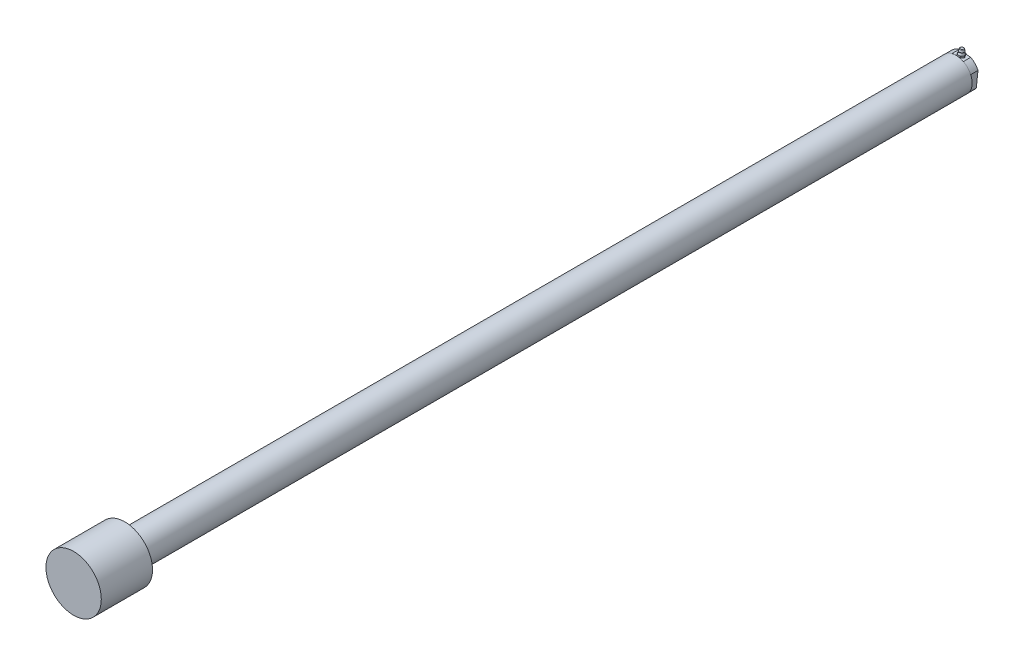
ISO-10303-21;
HEADER;
FILE_DESCRIPTION(('STEP AP214'),'2;1');
FILE_NAME('part.step','',(''),(''),'','','');
FILE_SCHEMA(('AUTOMOTIVE_DESIGN { 1 0 10303 214 1 1 1 1 }'));
ENDSEC;
DATA;
#1=APPLICATION_CONTEXT('core data for automotive mechanical design processes');
#2=APPLICATION_PROTOCOL_DEFINITION('international standard','automotive_design',2000,#1);
#3=PRODUCT_CONTEXT('',#1,'mechanical');
#4=PRODUCT('Part','Part','',(#3));
#5=PRODUCT_RELATED_PRODUCT_CATEGORY('part','',(#4));
#6=PRODUCT_DEFINITION_FORMATION('','',#4);
#7=PRODUCT_DEFINITION_CONTEXT('part definition',#1,'design');
#8=PRODUCT_DEFINITION('design','',#6,#7);
#9=PRODUCT_DEFINITION_SHAPE('','',#8);
#10=(LENGTH_UNIT() NAMED_UNIT(*) SI_UNIT(.MILLI.,.METRE.));
#11=(NAMED_UNIT(*) PLANE_ANGLE_UNIT() SI_UNIT($,.RADIAN.));
#12=(NAMED_UNIT(*) SI_UNIT($,.STERADIAN.) SOLID_ANGLE_UNIT());
#13=UNCERTAINTY_MEASURE_WITH_UNIT(LENGTH_MEASURE(1.E-05),#10,'distance_accuracy_value','');
#14=(GEOMETRIC_REPRESENTATION_CONTEXT(3) GLOBAL_UNCERTAINTY_ASSIGNED_CONTEXT((#13)) GLOBAL_UNIT_ASSIGNED_CONTEXT((#10,
#11,#12)) REPRESENTATION_CONTEXT('',''));
#15=CARTESIAN_POINT('',(0.,0.,0.));
#16=DIRECTION('',(0.,0.,1.));
#17=DIRECTION('',(1.,0.,0.));
#18=AXIS2_PLACEMENT_3D('',#15,#16,#17);
#19=CARTESIAN_POINT('',(0.127238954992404,23.1315063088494,-1188.19295));
#20=DIRECTION('',(0.104528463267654,0.994521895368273,0.));
#21=DIRECTION('',(0.994521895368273,-0.104528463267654,0.));
#22=AXIS2_PLACEMENT_3D('',#19,#20,#21);
#23=PLANE('',#22);
#24=CARTESIAN_POINT('',(2.40604553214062,22.8919940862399,-1184.2242));
#25=DIRECTION('',(-0.104528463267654,-0.994521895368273,0.));
#26=DIRECTION('',(0.,0.,-1.));
#27=AXIS2_PLACEMENT_3D('',#24,#25,#26);
#28=CIRCLE('',#27,3.96875);
#29=CARTESIAN_POINT('',(2.40604553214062,22.8919940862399,-1180.25545));
#30=VERTEX_POINT('',#29);
#31=CARTESIAN_POINT('',(-1.0121643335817,23.2512624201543,-1182.239825));
#32=VERTEX_POINT('',#31);
#33=EDGE_CURVE('E147',#30,#32,#28,.T.);
#34=ORIENTED_EDGE('',*,*,#33,.T.);
#35=DIRECTION('',(0.497260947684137,-0.0522642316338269,0.866025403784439));
#36=VECTOR('',#35,1.);
#37=CARTESIAN_POINT('',(-2.15156762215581,23.371018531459,-1184.2242));
#38=LINE('',#37,#36);
#39=CARTESIAN_POINT('',(0.127238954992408,23.1315063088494,-1180.25545));
#40=VERTEX_POINT('',#39);
#41=EDGE_CURVE('E161',#32,#40,#38,.T.);
#42=ORIENTED_EDGE('',*,*,#41,.T.);
#43=DIRECTION('',(0.994521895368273,-0.104528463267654,0.));
#44=VECTOR('',#43,1.);
#45=CARTESIAN_POINT('',(0.127238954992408,23.1315063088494,-1180.25545));
#46=LINE('',#45,#44);
#47=EDGE_CURVE('E154',#40,#30,#46,.T.);
#48=ORIENTED_EDGE('',*,*,#47,.T.);
#49=EDGE_LOOP('',(#34,#42,#48));
#50=FACE_BOUND('',#49,.T.);
#51=ADVANCED_FACE('F17',(#50),#23,.T.);
#52=CARTESIAN_POINT('',(5.82425539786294,22.5327257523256,-1182.239825));
#53=VERTEX_POINT('',#52);
#54=EDGE_CURVE('E136',#53,#30,#28,.T.);
#55=ORIENTED_EDGE('',*,*,#54,.T.);
#56=CARTESIAN_POINT('',(4.68485210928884,22.6524818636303,-1180.25545));
#57=VERTEX_POINT('',#56);
#58=EDGE_CURVE('E139',#30,#57,#46,.T.);
#59=ORIENTED_EDGE('',*,*,#58,.T.);
#60=DIRECTION('',(0.497260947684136,-0.0522642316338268,-0.866025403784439));
#61=VECTOR('',#60,1.);
#62=CARTESIAN_POINT('',(4.68485210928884,22.6524818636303,-1180.25545));
#63=LINE('',#62,#61);
#64=EDGE_CURVE('E142',#57,#53,#63,.T.);
#65=ORIENTED_EDGE('',*,*,#64,.T.);
#66=EDGE_LOOP('',(#55,#59,#65));
#67=FACE_BOUND('',#66,.T.);
#68=ADVANCED_FACE('F138',(#67),#23,.T.);
#69=CARTESIAN_POINT('',(5.82425539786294,22.5327257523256,-1186.208575));
#70=VERTEX_POINT('',#69);
#71=EDGE_CURVE('E146',#70,#53,#28,.T.);
#72=ORIENTED_EDGE('',*,*,#71,.T.);
#73=CARTESIAN_POINT('',(6.96365868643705,22.4129696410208,-1184.2242));
#74=VERTEX_POINT('',#73);
#75=EDGE_CURVE('E163',#53,#74,#63,.T.);
#76=ORIENTED_EDGE('',*,*,#75,.T.);
#77=DIRECTION('',(-0.497260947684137,0.0522642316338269,-0.866025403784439));
#78=VECTOR('',#77,1.);
#79=CARTESIAN_POINT('',(6.96365868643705,22.4129696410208,-1184.2242));
#80=LINE('',#79,#78);
#81=EDGE_CURVE('E182',#74,#70,#80,.T.);
#82=ORIENTED_EDGE('',*,*,#81,.T.);
#83=EDGE_LOOP('',(#72,#76,#82));
#84=FACE_BOUND('',#83,.T.);
#85=ADVANCED_FACE('F304',(#84),#23,.T.);
#86=CARTESIAN_POINT('',(2.40604553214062,22.8919940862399,-1188.19295));
#87=VERTEX_POINT('',#86);
#88=EDGE_CURVE('E37',#87,#70,#28,.T.);
#89=ORIENTED_EDGE('',*,*,#88,.T.);
#90=CARTESIAN_POINT('',(4.68485210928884,22.6524818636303,-1188.19295));
#91=VERTEX_POINT('',#90);
#92=EDGE_CURVE('E181',#70,#91,#80,.T.);
#93=ORIENTED_EDGE('',*,*,#92,.T.);
#94=DIRECTION('',(-0.994521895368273,0.104528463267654,0.));
#95=VECTOR('',#94,1.);
#96=CARTESIAN_POINT('',(4.68485210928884,22.6524818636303,-1188.19295));
#97=LINE('',#96,#95);
#98=EDGE_CURVE('E172',#91,#87,#97,.T.);
#99=ORIENTED_EDGE('',*,*,#98,.T.);
#100=EDGE_LOOP('',(#89,#93,#99));
#101=FACE_BOUND('',#100,.T.);
#102=ADVANCED_FACE('F322',(#101),#23,.T.);
#103=CARTESIAN_POINT('',(-1.0121643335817,23.2512624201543,-1186.208575));
#104=VERTEX_POINT('',#103);
#105=EDGE_CURVE('E167',#104,#87,#28,.T.);
#106=ORIENTED_EDGE('',*,*,#105,.T.);
#107=CARTESIAN_POINT('',(0.127238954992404,23.1315063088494,-1188.19295));
#108=VERTEX_POINT('',#107);
#109=EDGE_CURVE('E175',#87,#108,#97,.T.);
#110=ORIENTED_EDGE('',*,*,#109,.T.);
#111=DIRECTION('',(-0.497260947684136,0.0522642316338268,0.866025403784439));
#112=VECTOR('',#111,1.);
#113=CARTESIAN_POINT('',(0.127238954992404,23.1315063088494,-1188.19295));
#114=LINE('',#113,#112);
#115=EDGE_CURVE('E176',#108,#104,#114,.T.);
#116=ORIENTED_EDGE('',*,*,#115,.T.);
#117=EDGE_LOOP('',(#106,#110,#116));
#118=FACE_BOUND('',#117,.T.);
#119=ADVANCED_FACE('F310',(#118),#23,.T.);
#120=CARTESIAN_POINT('',(4.68485210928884,22.6524818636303,-1188.19295));
#121=DIRECTION('',(0.,0.,1.));
#122=DIRECTION('',(-0.104528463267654,-0.994521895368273,0.));
#123=AXIS2_PLACEMENT_3D('',#120,#121,#122);
#124=PLANE('',#123);
#125=DIRECTION('',(-0.994521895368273,0.104528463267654,0.));
#126=VECTOR('',#125,1.);
#127=CARTESIAN_POINT('',(4.43594370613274,20.2842766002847,-1188.19295));
#128=LINE('',#127,#126);
#129=CARTESIAN_POINT('',(4.43594370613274,20.2842766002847,-1188.19295));
#130=VERTEX_POINT('',#129);
#131=CARTESIAN_POINT('',(-0.121669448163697,20.7633010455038,-1188.19295));
#132=VERTEX_POINT('',#131);
#133=EDGE_CURVE('E170',#130,#132,#128,.T.);
#134=ORIENTED_EDGE('',*,*,#133,.T.);
#135=DIRECTION('',(-0.104528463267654,-0.994521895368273,0.));
#136=VECTOR('',#135,1.);
#137=CARTESIAN_POINT('',(0.127238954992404,23.1315063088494,-1188.19295));
#138=LINE('',#137,#136);
#139=EDGE_CURVE('E209',#108,#132,#138,.T.);
#140=ORIENTED_EDGE('',*,*,#139,.F.);
#141=ORIENTED_EDGE('',*,*,#109,.F.);
#142=ORIENTED_EDGE('',*,*,#98,.F.);
#143=DIRECTION('',(-0.104528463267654,-0.994521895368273,0.));
#144=VECTOR('',#143,1.);
#145=CARTESIAN_POINT('',(4.68485210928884,22.6524818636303,-1188.19295));
#146=LINE('',#145,#144);
#147=EDGE_CURVE('E185',#91,#130,#146,.T.);
#148=ORIENTED_EDGE('',*,*,#147,.T.);
#149=EDGE_LOOP('',(#134,#140,#141,#142,#148));
#150=FACE_BOUND('',#149,.T.);
#151=ADVANCED_FACE('F321',(#150),#124,.F.);
#152=CARTESIAN_POINT('',(0.127238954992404,23.1315063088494,-1188.19295));
#153=DIRECTION('',(0.861281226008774,-0.0905243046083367,0.5));
#154=DIRECTION('',(0.497260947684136,-0.0522642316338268,-0.866025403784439));
#155=AXIS2_PLACEMENT_3D('',#152,#153,#154);
#156=PLANE('',#155);
#157=DIRECTION('',(-0.497260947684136,0.0522642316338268,0.866025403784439));
#158=VECTOR('',#157,1.);
#159=CARTESIAN_POINT('',(-0.121669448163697,20.7633010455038,-1188.19295));
#160=LINE('',#159,#158);
#161=CARTESIAN_POINT('',(-2.40047602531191,21.0028132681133,-1184.2242));
#162=VERTEX_POINT('',#161);
#163=EDGE_CURVE('E188',#132,#162,#160,.T.);
#164=ORIENTED_EDGE('',*,*,#163,.T.);
#165=DIRECTION('',(-0.104528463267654,-0.994521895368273,0.));
#166=VECTOR('',#165,1.);
#167=CARTESIAN_POINT('',(-2.15156762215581,23.371018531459,-1184.2242));
#168=LINE('',#167,#166);
#169=CARTESIAN_POINT('',(-2.15156762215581,23.371018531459,-1184.2242));
#170=VERTEX_POINT('',#169);
#171=EDGE_CURVE('E206',#170,#162,#168,.T.);
#172=ORIENTED_EDGE('',*,*,#171,.F.);
#173=EDGE_CURVE('E174',#104,#170,#114,.T.);
#174=ORIENTED_EDGE('',*,*,#173,.F.);
#175=ORIENTED_EDGE('',*,*,#115,.F.);
#176=ORIENTED_EDGE('',*,*,#139,.T.);
#177=EDGE_LOOP('',(#164,#172,#174,#175,#176));
#178=FACE_BOUND('',#177,.T.);
#179=ADVANCED_FACE('F329',(#178),#156,.F.);
#180=CARTESIAN_POINT('',(-2.15156762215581,23.371018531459,-1184.2242));
#181=DIRECTION('',(0.861281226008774,-0.0905243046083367,-0.5));
#182=DIRECTION('',(-0.497260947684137,0.0522642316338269,-0.866025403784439));
#183=AXIS2_PLACEMENT_3D('',#180,#181,#182);
#184=PLANE('',#183);
#185=DIRECTION('',(0.497260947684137,-0.0522642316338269,0.866025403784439));
#186=VECTOR('',#185,1.);
#187=CARTESIAN_POINT('',(-2.40047602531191,21.0028132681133,-1184.2242));
#188=LINE('',#187,#186);
#189=CARTESIAN_POINT('',(-0.121669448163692,20.7633010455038,-1180.25545));
#190=VERTEX_POINT('',#189);
#191=EDGE_CURVE('E190',#162,#190,#188,.T.);
#192=ORIENTED_EDGE('',*,*,#191,.T.);
#193=DIRECTION('',(-0.104528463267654,-0.994521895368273,0.));
#194=VECTOR('',#193,1.);
#195=CARTESIAN_POINT('',(0.127238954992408,23.1315063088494,-1180.25545));
#196=LINE('',#195,#194);
#197=EDGE_CURVE('E204',#40,#190,#196,.T.);
#198=ORIENTED_EDGE('',*,*,#197,.F.);
#199=ORIENTED_EDGE('',*,*,#41,.F.);
#200=EDGE_CURVE('E92',#170,#32,#38,.T.);
#201=ORIENTED_EDGE('',*,*,#200,.F.);
#202=ORIENTED_EDGE('',*,*,#171,.T.);
#203=EDGE_LOOP('',(#192,#198,#199,#201,#202));
#204=FACE_BOUND('',#203,.T.);
#205=ADVANCED_FACE('F351',(#204),#184,.F.);
#206=CARTESIAN_POINT('',(0.127238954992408,23.1315063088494,-1180.25545));
#207=DIRECTION('',(0.,0.,-1.));
#208=DIRECTION('',(-0.994521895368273,0.104528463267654,0.));
#209=AXIS2_PLACEMENT_3D('',#206,#207,#208);
#210=PLANE('',#209);
#211=DIRECTION('',(0.994521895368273,-0.104528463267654,0.));
#212=VECTOR('',#211,1.);
#213=CARTESIAN_POINT('',(-0.121669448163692,20.7633010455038,-1180.25545));
#214=LINE('',#213,#212);
#215=CARTESIAN_POINT('',(4.43594370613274,20.2842766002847,-1180.25545));
#216=VERTEX_POINT('',#215);
#217=EDGE_CURVE('E192',#190,#216,#214,.T.);
#218=ORIENTED_EDGE('',*,*,#217,.T.);
#219=DIRECTION('',(-0.104528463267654,-0.994521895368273,0.));
#220=VECTOR('',#219,1.);
#221=CARTESIAN_POINT('',(4.68485210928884,22.6524818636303,-1180.25545));
#222=LINE('',#221,#220);
#223=EDGE_CURVE('E156',#57,#216,#222,.T.);
#224=ORIENTED_EDGE('',*,*,#223,.F.);
#225=ORIENTED_EDGE('',*,*,#58,.F.);
#226=ORIENTED_EDGE('',*,*,#47,.F.);
#227=ORIENTED_EDGE('',*,*,#197,.T.);
#228=EDGE_LOOP('',(#218,#224,#225,#226,#227));
#229=FACE_BOUND('',#228,.T.);
#230=ADVANCED_FACE('F152',(#229),#210,.F.);
#231=CARTESIAN_POINT('',(4.68485210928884,22.6524818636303,-1180.25545));
#232=DIRECTION('',(-0.861281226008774,0.0905243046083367,-0.5));
#233=DIRECTION('',(-0.497260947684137,0.0522642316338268,0.866025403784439));
#234=AXIS2_PLACEMENT_3D('',#231,#232,#233);
#235=PLANE('',#234);
#236=DIRECTION('',(0.497260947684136,-0.0522642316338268,-0.866025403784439));
#237=VECTOR('',#236,1.);
#238=CARTESIAN_POINT('',(4.43594370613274,20.2842766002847,-1180.25545));
#239=LINE('',#238,#237);
#240=CARTESIAN_POINT('',(6.71475028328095,20.0447643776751,-1184.2242));
#241=VERTEX_POINT('',#240);
#242=EDGE_CURVE('E194',#216,#241,#239,.T.);
#243=ORIENTED_EDGE('',*,*,#242,.T.);
#244=DIRECTION('',(-0.104528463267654,-0.994521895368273,0.));
#245=VECTOR('',#244,1.);
#246=CARTESIAN_POINT('',(6.96365868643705,22.4129696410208,-1184.2242));
#247=LINE('',#246,#245);
#248=EDGE_CURVE('E200',#74,#241,#247,.T.);
#249=ORIENTED_EDGE('',*,*,#248,.F.);
#250=ORIENTED_EDGE('',*,*,#75,.F.);
#251=ORIENTED_EDGE('',*,*,#64,.F.);
#252=ORIENTED_EDGE('',*,*,#223,.T.);
#253=EDGE_LOOP('',(#243,#249,#250,#251,#252));
#254=FACE_BOUND('',#253,.T.);
#255=ADVANCED_FACE('F318',(#254),#235,.F.);
#256=CARTESIAN_POINT('',(6.96365868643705,22.4129696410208,-1184.2242));
#257=DIRECTION('',(-0.861281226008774,0.0905243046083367,0.5));
#258=DIRECTION('',(0.497260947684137,-0.0522642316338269,0.866025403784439));
#259=AXIS2_PLACEMENT_3D('',#256,#257,#258);
#260=PLANE('',#259);
#261=DIRECTION('',(-0.497260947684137,0.0522642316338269,-0.866025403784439));
#262=VECTOR('',#261,1.);
#263=CARTESIAN_POINT('',(6.71475028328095,20.0447643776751,-1184.2242));
#264=LINE('',#263,#262);
#265=EDGE_CURVE('E196',#241,#130,#264,.T.);
#266=ORIENTED_EDGE('',*,*,#265,.T.);
#267=ORIENTED_EDGE('',*,*,#147,.F.);
#268=ORIENTED_EDGE('',*,*,#92,.F.);
#269=ORIENTED_EDGE('',*,*,#81,.F.);
#270=ORIENTED_EDGE('',*,*,#248,.T.);
#271=EDGE_LOOP('',(#266,#267,#268,#269,#270));
#272=FACE_BOUND('',#271,.T.);
#273=ADVANCED_FACE('F309',(#272),#260,.F.);
#274=EDGE_CURVE('E166',#32,#104,#28,.T.);
#275=ORIENTED_EDGE('',*,*,#274,.T.);
#276=ORIENTED_EDGE('',*,*,#173,.T.);
#277=ORIENTED_EDGE('',*,*,#200,.T.);
#278=EDGE_LOOP('',(#275,#276,#277));
#279=FACE_BOUND('',#278,.T.);
#280=ADVANCED_FACE('F299',(#279),#23,.T.);
#281=CARTESIAN_POINT('',(2.79268325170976,26.5706062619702,-1184.2242));
#282=DIRECTION('',(-0.104528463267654,-0.994521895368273,0.));
#283=DIRECTION('',(0.,0.,-1.));
#284=AXIS2_PLACEMENT_3D('',#281,#282,#283);
#285=CONICAL_SURFACE('',#284,3.3655,0.340381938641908);
#286=CARTESIAN_POINT('',(3.05822647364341,29.0970812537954,-1184.2242));
#287=DIRECTION('',(0.104528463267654,0.994521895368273,0.));
#288=DIRECTION('',(0.,0.,1.));
#289=AXIS2_PLACEMENT_3D('',#286,#287,#288);
#290=CIRCLE('',#289,2.46577800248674);
#291=CARTESIAN_POINT('',(3.0582264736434,29.0970812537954,-1186.68997800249));
#292=VERTEX_POINT('',#291);
#293=EDGE_CURVE('E212',#292,#292,#290,.F.);
#294=CARTESIAN_POINT('',(2.79268325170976,26.5706062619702,-1184.2242));
#295=DIRECTION('',(-0.104528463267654,-0.994521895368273,0.));
#296=DIRECTION('',(0.,0.,-1.));
#297=AXIS2_PLACEMENT_3D('',#294,#295,#296);
#298=CIRCLE('',#297,3.3655);
#299=CARTESIAN_POINT('',(2.79268325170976,26.5706062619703,-1187.5897));
#300=VERTEX_POINT('',#299);
#301=EDGE_CURVE('E171',#300,#300,#298,.T.);
#302=CARTESIAN_POINT('',(3.0582264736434,29.0970812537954,-1186.68997800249));
#303=CARTESIAN_POINT('',(3.05546039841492,29.0707638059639,-1186.69935010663));
#304=CARTESIAN_POINT('',(3.05269432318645,29.0444463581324,-1186.70872221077));
#305=CARTESIAN_POINT('',(3.0471621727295,28.9918114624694,-1186.72746641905));
#306=CARTESIAN_POINT('',(3.04439609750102,28.9654940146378,-1186.73683852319));
#307=CARTESIAN_POINT('',(3.03886394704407,28.9128591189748,-1186.75558273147));
#308=CARTESIAN_POINT('',(3.0360978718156,28.8865416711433,-1186.76495483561));
#309=CARTESIAN_POINT('',(3.03056572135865,28.8339067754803,-1186.78369904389));
#310=CARTESIAN_POINT('',(3.02779964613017,28.8075893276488,-1186.79307114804));
#311=CARTESIAN_POINT('',(3.02226749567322,28.7549544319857,-1186.81181535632));
#312=CARTESIAN_POINT('',(3.01950142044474,28.7286369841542,-1186.82118746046));
#313=CARTESIAN_POINT('',(3.01396926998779,28.6760020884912,-1186.83993166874));
#314=CARTESIAN_POINT('',(3.01120319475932,28.6496846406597,-1186.84930377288));
#315=CARTESIAN_POINT('',(3.00567104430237,28.5970497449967,-1186.86804798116));
#316=CARTESIAN_POINT('',(3.00290496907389,28.5707322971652,-1186.8774200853));
#317=CARTESIAN_POINT('',(2.99737281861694,28.5180974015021,-1186.89616429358));
#318=CARTESIAN_POINT('',(2.99460674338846,28.4917799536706,-1186.90553639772));
#319=CARTESIAN_POINT('',(2.98907459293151,28.4391450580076,-1186.92428060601));
#320=CARTESIAN_POINT('',(2.98630851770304,28.4128276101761,-1186.93365271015));
#321=CARTESIAN_POINT('',(2.98077636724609,28.3601927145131,-1186.95239691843));
#322=CARTESIAN_POINT('',(2.97801029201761,28.3338752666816,-1186.96176902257));
#323=CARTESIAN_POINT('',(2.97247814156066,28.2812403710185,-1186.98051323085));
#324=CARTESIAN_POINT('',(2.96971206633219,28.254922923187,-1186.98988533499));
#325=CARTESIAN_POINT('',(2.96417991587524,28.202288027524,-1187.00862954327));
#326=CARTESIAN_POINT('',(2.96141384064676,28.1759705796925,-1187.01800164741));
#327=CARTESIAN_POINT('',(2.95588169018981,28.1233356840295,-1187.0367458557));
#328=CARTESIAN_POINT('',(2.95311561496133,28.0970182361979,-1187.04611795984));
#329=CARTESIAN_POINT('',(2.94758346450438,28.0443833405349,-1187.06486216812));
#330=CARTESIAN_POINT('',(2.94481738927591,28.0180658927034,-1187.07423427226));
#331=CARTESIAN_POINT('',(2.93928523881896,27.9654309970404,-1187.09297848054));
#332=CARTESIAN_POINT('',(2.93651916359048,27.9391135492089,-1187.10235058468));
#333=CARTESIAN_POINT('',(2.93098701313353,27.8864786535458,-1187.12109479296));
#334=CARTESIAN_POINT('',(2.92822093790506,27.8601612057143,-1187.1304668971));
#335=CARTESIAN_POINT('',(2.92268878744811,27.8075263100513,-1187.14921110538));
#336=CARTESIAN_POINT('',(2.91992271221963,27.7812088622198,-1187.15858320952));
#337=CARTESIAN_POINT('',(2.91439056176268,27.7285739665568,-1187.17732741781));
#338=CARTESIAN_POINT('',(2.9116244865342,27.7022565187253,-1187.18669952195));
#339=CARTESIAN_POINT('',(2.90609233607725,27.6496216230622,-1187.20544373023));
#340=CARTESIAN_POINT('',(2.90332626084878,27.6233041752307,-1187.21481583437));
#341=CARTESIAN_POINT('',(2.89779411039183,27.5706692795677,-1187.23356004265));
#342=CARTESIAN_POINT('',(2.89502803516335,27.5443518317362,-1187.24293214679));
#343=CARTESIAN_POINT('',(2.8894958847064,27.4917169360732,-1187.26167635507));
#344=CARTESIAN_POINT('',(2.88672980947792,27.4653994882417,-1187.27104845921));
#345=CARTESIAN_POINT('',(2.88119765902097,27.4127645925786,-1187.2897926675));
#346=CARTESIAN_POINT('',(2.8784315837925,27.3864471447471,-1187.29916477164));
#347=CARTESIAN_POINT('',(2.87289943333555,27.3338122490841,-1187.31790897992));
#348=CARTESIAN_POINT('',(2.87013335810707,27.3074948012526,-1187.32728108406));
#349=CARTESIAN_POINT('',(2.86460120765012,27.2548599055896,-1187.34602529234));
#350=CARTESIAN_POINT('',(2.86183513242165,27.2285424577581,-1187.35539739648));
#351=CARTESIAN_POINT('',(2.85630298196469,27.175907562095,-1187.37414160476));
#352=CARTESIAN_POINT('',(2.85353690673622,27.1495901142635,-1187.3835137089));
#353=CARTESIAN_POINT('',(2.84800475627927,27.0969552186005,-1187.40225791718));
#354=CARTESIAN_POINT('',(2.84523868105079,27.070637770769,-1187.41163002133));
#355=CARTESIAN_POINT('',(2.83970653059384,27.018002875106,-1187.43037422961));
#356=CARTESIAN_POINT('',(2.83694045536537,26.9916854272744,-1187.43974633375));
#357=CARTESIAN_POINT('',(2.83140830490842,26.9390505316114,-1187.45849054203));
#358=CARTESIAN_POINT('',(2.82864222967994,26.9127330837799,-1187.46786264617));
#359=CARTESIAN_POINT('',(2.82311007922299,26.8600981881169,-1187.48660685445));
#360=CARTESIAN_POINT('',(2.82034400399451,26.8337807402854,-1187.49597895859));
#361=CARTESIAN_POINT('',(2.81481185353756,26.7811458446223,-1187.51472316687));
#362=CARTESIAN_POINT('',(2.81204577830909,26.7548283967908,-1187.52409527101));
#363=CARTESIAN_POINT('',(2.80651362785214,26.7021935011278,-1187.5428394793));
#364=CARTESIAN_POINT('',(2.80374755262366,26.6758760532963,-1187.55221158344));
#365=CARTESIAN_POINT('',(2.79821540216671,26.6232411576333,-1187.57095579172));
#366=CARTESIAN_POINT('',(2.79544932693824,26.5969237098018,-1187.58032789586));
#367=CARTESIAN_POINT('',(2.79268325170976,26.5706062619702,-1187.5897));
#368=B_SPLINE_CURVE_WITH_KNOTS('',3,(#302,#303,#304,#305,#306,#307,#308,#309,#310,#311,#312,
#313,#314,#315,#316,#317,#318,#319,#320,#321,#322,#323,#324,#325,#326,#327,#328,#329,#330,#331,
#332,#333,#334,#335,#336,#337,#338,#339,#340,#341,#342,#343,#344,#345,#346,#347,#348,#349,#350,
#351,#352,#353,#354,#355,#356,#357,#358,#359,#360,#361,#362,#363,#364,#365,#366,#367),
.UNSPECIFIED.,.F.,.F.,(4,2,2,2,2,2,2,2,2,2,2,2,2,2,2,2,2,2,2,2,2,2,2,2,2,2,2,2,2,2,2,2,4),(0.,
0.0842191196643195,0.168438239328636,0.252657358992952,0.336876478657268,0.421095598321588,
0.505314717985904,0.58953383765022,0.673752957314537,0.757972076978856,0.842191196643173,
0.926410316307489,1.0106294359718,1.09484855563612,1.17906767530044,1.26328679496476,
1.34750591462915,1.43172503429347,1.51594415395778,1.6001632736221,1.68438239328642,
1.76860151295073,1.85282063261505,1.93703975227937,2.02125887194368,2.105477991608,
2.18969711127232,2.27391623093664,2.35813535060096,2.44235447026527,2.52657358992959,
2.6107927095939,2.69501182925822),.UNSPECIFIED.);
#369=EDGE_CURVE('BSEAM308',#292,#300,#368,.T.);
#370=ORIENTED_EDGE('',*,*,#293,.T.);
#371=ORIENTED_EDGE('',*,*,#301,.F.);
#372=ORIENTED_EDGE('',*,*,#369,.T.);
#373=ORIENTED_EDGE('',*,*,#369,.F.);
#374=EDGE_LOOP('',(#370,#372,#371,#373));
#375=FACE_BOUND('',#374,.T.);
#376=ADVANCED_FACE('F308',(#375),#285,.T.);
#377=CARTESIAN_POINT('',(3.11128600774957,29.6019089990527,-1184.2242));
#378=DIRECTION('',(0.104528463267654,0.994521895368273,0.));
#379=DIRECTION('',(0.,0.,1.));
#380=AXIS2_PLACEMENT_3D('',#377,#378,#379);
#381=PLANE('',#380);
#382=CARTESIAN_POINT('',(3.11128600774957,29.6019089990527,-1184.2242));
#383=DIRECTION('',(0.104528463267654,0.994521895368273,0.));
#384=DIRECTION('',(0.,0.,1.));
#385=AXIS2_PLACEMENT_3D('',#382,#383,#384);
#386=CIRCLE('',#385,1.7474960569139);
#387=CARTESIAN_POINT('',(3.11128600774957,29.6019089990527,-1182.47670394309));
#388=VERTEX_POINT('',#387);
#389=EDGE_CURVE('E28',#388,#388,#386,.T.);
#390=ORIENTED_EDGE('',*,*,#389,.T.);
#391=EDGE_LOOP('',(#390));
#392=FACE_BOUND('',#391,.T.);
#393=ADVANCED_FACE('F316',(#392),#381,.T.);
#394=CARTESIAN_POINT('',(2.62561438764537,24.9810522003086,-1184.2242));
#395=DIRECTION('',(-0.104528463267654,-0.994521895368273,0.));
#396=DIRECTION('',(0.,0.,-1.));
#397=AXIS2_PLACEMENT_3D('',#394,#395,#396);
#398=TOROIDAL_SURFACE('',#397,5.20693450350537,2.43833450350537);
#399=ORIENTED_EDGE('',*,*,#301,.T.);
#400=EDGE_LOOP('',(#399));
#401=FACE_BOUND('',#400,.T.);
#402=ORIENTED_EDGE('',*,*,#88,.F.);
#403=ORIENTED_EDGE('',*,*,#105,.F.);
#404=ORIENTED_EDGE('',*,*,#274,.F.);
#405=ORIENTED_EDGE('',*,*,#33,.F.);
#406=ORIENTED_EDGE('',*,*,#54,.F.);
#407=ORIENTED_EDGE('',*,*,#71,.F.);
#408=EDGE_LOOP('',(#402,#403,#404,#405,#406,#407));
#409=FACE_BOUND('',#408,.T.);
#410=ADVANCED_FACE('F164',(#401,#409),#398,.F.);
#411=CARTESIAN_POINT('',(3.03163531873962,28.8440833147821,-1184.2242));
#412=DIRECTION('',(0.104528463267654,0.994521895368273,0.));
#413=DIRECTION('',(0.,0.,1.));
#414=AXIS2_PLACEMENT_3D('',#411,#412,#413);
#415=TOROIDAL_SURFACE('',#414,1.7474960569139,0.762);
#416=ORIENTED_EDGE('',*,*,#389,.F.);
#417=EDGE_LOOP('',(#416));
#418=FACE_BOUND('',#417,.T.);
#419=ORIENTED_EDGE('',*,*,#293,.F.);
#420=EDGE_LOOP('',(#419));
#421=FACE_BOUND('',#420,.T.);
#422=ADVANCED_FACE('F410',(#418,#421),#415,.T.);
#423=CARTESIAN_POINT('',(0.,0.,35.56));
#424=DIRECTION('',(0.,0.,1.));
#425=DIRECTION('',(1.,0.,0.));
#426=AXIS2_PLACEMENT_3D('',#423,#424,#425);
#427=PLANE('',#426);
#428=CARTESIAN_POINT('',(0.,0.,35.56));
#429=DIRECTION('',(0.,0.,1.));
#430=DIRECTION('',(1.,0.,0.));
#431=AXIS2_PLACEMENT_3D('',#428,#429,#430);
#432=CIRCLE('',#431,38.1);
#433=CARTESIAN_POINT('',(38.1,0.,35.56));
#434=VERTEX_POINT('',#433);
#435=EDGE_CURVE('E261',#434,#434,#432,.T.);
#436=ORIENTED_EDGE('',*,*,#435,.T.);
#437=EDGE_LOOP('',(#436));
#438=FACE_BOUND('',#437,.T.);
#439=ADVANCED_FACE('F412',(#438),#427,.T.);
#440=CARTESIAN_POINT('',(0.,0.,-34.925));
#441=DIRECTION('',(0.,0.,1.));
#442=DIRECTION('',(1.,0.,0.));
#443=AXIS2_PLACEMENT_3D('',#440,#441,#442);
#444=CYLINDRICAL_SURFACE('',#443,38.1);
#445=CARTESIAN_POINT('',(0.,0.,-34.925));
#446=DIRECTION('',(0.,0.,1.));
#447=DIRECTION('',(1.,0.,0.));
#448=AXIS2_PLACEMENT_3D('',#445,#446,#447);
#449=CIRCLE('',#448,38.1);
#450=CARTESIAN_POINT('',(38.1,0.,-34.925));
#451=VERTEX_POINT('',#450);
#452=EDGE_CURVE('E264',#451,#451,#449,.T.);
#453=ORIENTED_EDGE('',*,*,#452,.T.);
#454=EDGE_LOOP('',(#453));
#455=FACE_BOUND('',#454,.T.);
#456=ORIENTED_EDGE('',*,*,#435,.F.);
#457=EDGE_LOOP('',(#456));
#458=FACE_BOUND('',#457,.T.);
#459=ADVANCED_FACE('F408',(#455,#458),#444,.T.);
#460=CARTESIAN_POINT('',(0.,0.,-1151.2042));
#461=DIRECTION('',(0.,0.,-1.));
#462=DIRECTION('',(0.104528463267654,0.994521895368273,0.));
#463=AXIS2_PLACEMENT_3D('',#460,#461,#462);
#464=PLANE('',#463);
#465=CARTESIAN_POINT('',(0.,0.,-1151.2042));
#466=DIRECTION('',(0.,0.,-1.));
#467=DIRECTION('',(0.104528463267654,0.994521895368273,0.));
#468=AXIS2_PLACEMENT_3D('',#465,#466,#467);
#469=CIRCLE('',#468,8.73125);
#470=CARTESIAN_POINT('',(0.912664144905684,8.68341929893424,-1151.2042));
#471=VERTEX_POINT('',#470);
#472=EDGE_CURVE('E217',#471,#471,#469,.T.);
#473=ORIENTED_EDGE('',*,*,#472,.T.);
#474=EDGE_LOOP('',(#473));
#475=FACE_BOUND('',#474,.T.);
#476=ADVANCED_FACE('F292',(#475),#464,.T.);
#477=CARTESIAN_POINT('',(0.,0.,-34.925));
#478=DIRECTION('',(0.,0.,1.));
#479=DIRECTION('',(1.,0.,0.));
#480=AXIS2_PLACEMENT_3D('',#477,#478,#479);
#481=PLANE('',#480);
#482=ORIENTED_EDGE('',*,*,#452,.F.);
#483=EDGE_LOOP('',(#482));
#484=FACE_BOUND('',#483,.T.);
#485=CARTESIAN_POINT('',(0.,0.,-34.925));
#486=DIRECTION('',(0.,0.,1.));
#487=DIRECTION('',(1.,0.,0.));
#488=AXIS2_PLACEMENT_3D('',#485,#486,#487);
#489=CIRCLE('',#488,22.225);
#490=CARTESIAN_POINT('',(22.225,0.,-34.925));
#491=VERTEX_POINT('',#490);
#492=EDGE_CURVE('E21',#491,#491,#489,.T.);
#493=ORIENTED_EDGE('',*,*,#492,.T.);
#494=EDGE_LOOP('',(#493));
#495=FACE_BOUND('',#494,.T.);
#496=ADVANCED_FACE('F273',(#484,#495),#481,.F.);
#497=CARTESIAN_POINT('',(0.,0.,-1189.3042));
#498=DIRECTION('',(0.,0.,-1.));
#499=DIRECTION('',(0.104528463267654,0.994521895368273,0.));
#500=AXIS2_PLACEMENT_3D('',#497,#498,#499);
#501=CYLINDRICAL_SURFACE('',#500,8.73125);
#502=ORIENTED_EDGE('',*,*,#472,.F.);
#503=EDGE_LOOP('',(#502));
#504=FACE_BOUND('',#503,.T.);
#505=CARTESIAN_POINT('',(0.,0.,-1189.3042));
#506=DIRECTION('',(0.,0.,-1.));
#507=DIRECTION('',(0.104528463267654,0.994521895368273,0.));
#508=AXIS2_PLACEMENT_3D('',#505,#506,#507);
#509=CIRCLE('',#508,8.73125);
#510=CARTESIAN_POINT('',(0.912664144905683,8.68341929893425,-1189.3042));
#511=VERTEX_POINT('',#510);
#512=EDGE_CURVE('E249',#511,#511,#509,.T.);
#513=ORIENTED_EDGE('',*,*,#512,.T.);
#514=EDGE_LOOP('',(#513));
#515=FACE_BOUND('',#514,.T.);
#516=ADVANCED_FACE('F277',(#504,#515),#501,.F.);
#517=CARTESIAN_POINT('',(0.,0.,-1179.1442));
#518=DIRECTION('',(0.,0.,1.));
#519=DIRECTION('',(1.,0.,0.));
#520=AXIS2_PLACEMENT_3D('',#517,#518,#519);
#521=CYLINDRICAL_SURFACE('',#520,22.225);
#522=CARTESIAN_POINT('',(0.,0.,-1179.1442));
#523=DIRECTION('',(0.,0.,-1.));
#524=DIRECTION('',(-1.,0.,0.));
#525=AXIS2_PLACEMENT_3D('',#522,#523,#524);
#526=CIRCLE('',#525,22.225);
#527=CARTESIAN_POINT('',(-22.2250000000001,0.,-1179.1442));
#528=VERTEX_POINT('',#527);
#529=EDGE_CURVE('E266',#528,#528,#526,.T.);
#530=ORIENTED_EDGE('',*,*,#529,.F.);
#531=EDGE_LOOP('',(#530));
#532=FACE_BOUND('',#531,.T.);
#533=ORIENTED_EDGE('',*,*,#492,.F.);
#534=EDGE_LOOP('',(#533));
#535=FACE_BOUND('',#534,.T.);
#536=ADVANCED_FACE('F19',(#532,#535),#521,.T.);
#537=CARTESIAN_POINT('',(17.7724035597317,-13.1538863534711,-1156.48829343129));
#538=DIRECTION('',(-0.994521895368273,0.104528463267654,0.));
#539=DIRECTION('',(0.104528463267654,0.994521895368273,0.));
#540=AXIS2_PLACEMENT_3D('',#537,#538,#539);
#541=PLANE('',#540);
#542=DIRECTION('',(-0.104528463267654,-0.994521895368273,0.));
#543=VECTOR('',#542,1.);
#544=CARTESIAN_POINT('',(17.7724035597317,-13.1538863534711,-1179.1442));
#545=LINE('',#544,#543);
#546=CARTESIAN_POINT('',(20.1188806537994,9.17135190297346,-1179.1442));
#547=VERTEX_POINT('',#546);
#548=CARTESIAN_POINT('',(17.7724035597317,-13.1538863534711,-1179.1442));
#549=VERTEX_POINT('',#548);
#550=EDGE_CURVE('E246',#547,#549,#545,.T.);
#551=ORIENTED_EDGE('',*,*,#550,.T.);
#552=DIRECTION('',(0.,0.,-1.));
#553=VECTOR('',#552,1.);
#554=CARTESIAN_POINT('',(17.7724035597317,-13.1538863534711,-1156.48829343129));
#555=LINE('',#554,#553);
#556=CARTESIAN_POINT('',(17.7724035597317,-13.1538863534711,-1189.3042));
#557=VERTEX_POINT('',#556);
#558=EDGE_CURVE('E242',#549,#557,#555,.T.);
#559=ORIENTED_EDGE('',*,*,#558,.T.);
#560=DIRECTION('',(0.104528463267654,0.994521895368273,0.));
#561=VECTOR('',#560,1.);
#562=CARTESIAN_POINT('',(17.7724035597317,-13.1538863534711,-1189.3042));
#563=LINE('',#562,#561);
#564=CARTESIAN_POINT('',(20.1188806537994,9.17135190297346,-1189.3042));
#565=VERTEX_POINT('',#564);
#566=EDGE_CURVE('E239',#557,#565,#563,.T.);
#567=ORIENTED_EDGE('',*,*,#566,.T.);
#568=DIRECTION('',(0.,0.,-1.));
#569=VECTOR('',#568,1.);
#570=CARTESIAN_POINT('',(20.1188806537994,9.17135190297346,-1156.48829343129));
#571=LINE('',#570,#569);
#572=EDGE_CURVE('E243',#547,#565,#571,.T.);
#573=ORIENTED_EDGE('',*,*,#572,.F.);
#574=EDGE_LOOP('',(#551,#559,#567,#573));
#575=FACE_BOUND('',#574,.T.);
#576=ADVANCED_FACE('F276',(#575),#541,.F.);
#577=CARTESIAN_POINT('',(0.,0.,-1179.1442));
#578=DIRECTION('',(0.,0.,-1.));
#579=DIRECTION('',(0.104528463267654,0.994521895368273,0.));
#580=AXIS2_PLACEMENT_3D('',#577,#578,#579);
#581=CYLINDRICAL_SURFACE('',#580,22.1107);
#582=DIRECTION('',(0.,0.,-1.));
#583=VECTOR('',#582,1.);
#584=CARTESIAN_POINT('',(-20.1188806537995,-9.17135190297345,-1156.48829343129));
#585=LINE('',#584,#583);
#586=CARTESIAN_POINT('',(-20.1188806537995,-9.17135190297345,-1179.1442));
#587=VERTEX_POINT('',#586);
#588=CARTESIAN_POINT('',(-20.1188806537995,-9.17135190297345,-1189.3042));
#589=VERTEX_POINT('',#588);
#590=EDGE_CURVE('E233',#587,#589,#585,.T.);
#591=ORIENTED_EDGE('',*,*,#590,.T.);
#592=CARTESIAN_POINT('',(0.,0.,-1189.3042));
#593=DIRECTION('',(0.,0.,-1.));
#594=DIRECTION('',(0.104528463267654,0.994521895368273,0.));
#595=AXIS2_PLACEMENT_3D('',#592,#593,#594);
#596=CIRCLE('',#595,22.1107);
#597=EDGE_CURVE('E257',#557,#589,#596,.T.);
#598=ORIENTED_EDGE('',*,*,#597,.F.);
#599=ORIENTED_EDGE('',*,*,#558,.F.);
#600=CARTESIAN_POINT('',(0.,0.,-1179.1442));
#601=DIRECTION('',(0.,0.,-1.));
#602=DIRECTION('',(0.104528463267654,0.994521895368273,0.));
#603=AXIS2_PLACEMENT_3D('',#600,#601,#602);
#604=CIRCLE('',#603,22.1107);
#605=EDGE_CURVE('E253',#549,#587,#604,.T.);
#606=ORIENTED_EDGE('',*,*,#605,.T.);
#607=EDGE_LOOP('',(#591,#598,#599,#606));
#608=FACE_BOUND('',#607,.T.);
#609=ADVANCED_FACE('F286',(#608),#581,.T.);
#610=CARTESIAN_POINT('',(-20.1188806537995,-9.17135190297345,-1156.48829343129));
#611=DIRECTION('',(0.994521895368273,-0.104528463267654,0.));
#612=DIRECTION('',(0.,0.,-1.));
#613=AXIS2_PLACEMENT_3D('',#610,#611,#612);
#614=PLANE('',#613);
#615=DIRECTION('',(0.104528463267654,0.994521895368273,0.));
#616=VECTOR('',#615,1.);
#617=CARTESIAN_POINT('',(-20.1188806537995,-9.17135190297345,-1179.1442));
#618=LINE('',#617,#616);
#619=CARTESIAN_POINT('',(-17.7724035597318,13.1538863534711,-1179.1442));
#620=VERTEX_POINT('',#619);
#621=EDGE_CURVE('E236',#587,#620,#618,.T.);
#622=ORIENTED_EDGE('',*,*,#621,.T.);
#623=DIRECTION('',(0.,0.,-1.));
#624=VECTOR('',#623,1.);
#625=CARTESIAN_POINT('',(-17.7724035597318,13.1538863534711,-1156.48829343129));
#626=LINE('',#625,#624);
#627=CARTESIAN_POINT('',(-17.7724035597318,13.1538863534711,-1189.3042));
#628=VERTEX_POINT('',#627);
#629=EDGE_CURVE('E77',#620,#628,#626,.T.);
#630=ORIENTED_EDGE('',*,*,#629,.T.);
#631=DIRECTION('',(-0.104528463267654,-0.994521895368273,0.));
#632=VECTOR('',#631,1.);
#633=CARTESIAN_POINT('',(-20.1188806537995,-9.17135190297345,-1189.3042));
#634=LINE('',#633,#632);
#635=EDGE_CURVE('E231',#628,#589,#634,.T.);
#636=ORIENTED_EDGE('',*,*,#635,.T.);
#637=ORIENTED_EDGE('',*,*,#590,.F.);
#638=EDGE_LOOP('',(#622,#630,#636,#637));
#639=FACE_BOUND('',#638,.T.);
#640=ADVANCED_FACE('F289',(#639),#614,.F.);
#641=DIRECTION('',(0.,0.,-1.));
#642=VECTOR('',#641,1.);
#643=CARTESIAN_POINT('',(-5.73688041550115,21.3534835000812,-1163.200929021));
#644=LINE('',#643,#642);
#645=CARTESIAN_POINT('',(-5.73688041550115,21.3534835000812,-1179.1442));
#646=VERTEX_POINT('',#645);
#647=CARTESIAN_POINT('',(-5.73688041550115,21.3534835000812,-1189.3042));
#648=VERTEX_POINT('',#647);
#649=EDGE_CURVE('E225',#646,#648,#644,.T.);
#650=ORIENTED_EDGE('',*,*,#649,.T.);
#651=EDGE_CURVE('E260',#628,#648,#596,.T.);
#652=ORIENTED_EDGE('',*,*,#651,.F.);
#653=ORIENTED_EDGE('',*,*,#629,.F.);
#654=EDGE_CURVE('E255',#620,#646,#604,.T.);
#655=ORIENTED_EDGE('',*,*,#654,.T.);
#656=EDGE_LOOP('',(#650,#652,#653,#655));
#657=FACE_BOUND('',#656,.T.);
#658=ADVANCED_FACE('F372',(#657),#581,.T.);
#659=CARTESIAN_POINT('',(0.,0.,-1189.3042));
#660=DIRECTION('',(0.,0.,-1.));
#661=DIRECTION('',(0.104528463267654,0.994521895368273,0.));
#662=AXIS2_PLACEMENT_3D('',#659,#660,#661);
#663=PLANE('',#662);
#664=DIRECTION('',(-0.994521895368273,0.104528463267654,0.));
#665=VECTOR('',#664,1.);
#666=CARTESIAN_POINT('',(10.0511546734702,19.6940941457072,-1189.3042));
#667=LINE('',#666,#665);
#668=CARTESIAN_POINT('',(10.0511546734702,19.6940941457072,-1189.3042));
#669=VERTEX_POINT('',#668);
#670=EDGE_CURVE('E223',#669,#648,#667,.T.);
#671=ORIENTED_EDGE('',*,*,#670,.F.);
#672=EDGE_CURVE('E252',#669,#565,#596,.T.);
#673=ORIENTED_EDGE('',*,*,#672,.T.);
#674=ORIENTED_EDGE('',*,*,#566,.F.);
#675=ORIENTED_EDGE('',*,*,#597,.T.);
#676=ORIENTED_EDGE('',*,*,#635,.F.);
#677=ORIENTED_EDGE('',*,*,#651,.T.);
#678=EDGE_LOOP('',(#671,#673,#674,#675,#676,#677));
#679=FACE_BOUND('',#678,.T.);
#680=ORIENTED_EDGE('',*,*,#512,.F.);
#681=EDGE_LOOP('',(#680));
#682=FACE_BOUND('',#681,.T.);
#683=ADVANCED_FACE('F369',(#679,#682),#663,.T.);
#684=DIRECTION('',(0.,0.,-1.));
#685=VECTOR('',#684,1.);
#686=CARTESIAN_POINT('',(10.0511546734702,19.6940941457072,-1163.200929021));
#687=LINE('',#686,#685);
#688=CARTESIAN_POINT('',(10.0511546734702,19.6940941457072,-1179.1442));
#689=VERTEX_POINT('',#688);
#690=EDGE_CURVE('E83',#689,#669,#687,.T.);
#691=ORIENTED_EDGE('',*,*,#690,.F.);
#692=EDGE_CURVE('E256',#689,#547,#604,.T.);
#693=ORIENTED_EDGE('',*,*,#692,.T.);
#694=ORIENTED_EDGE('',*,*,#572,.T.);
#695=ORIENTED_EDGE('',*,*,#672,.F.);
#696=EDGE_LOOP('',(#691,#693,#694,#695));
#697=FACE_BOUND('',#696,.T.);
#698=ADVANCED_FACE('F295',(#697),#581,.T.);
#699=CARTESIAN_POINT('',(0.,0.,-1179.1442));
#700=DIRECTION('',(0.,0.,-1.));
#701=DIRECTION('',(-1.,0.,0.));
#702=AXIS2_PLACEMENT_3D('',#699,#700,#701);
#703=PLANE('',#702);
#704=ORIENTED_EDGE('',*,*,#621,.F.);
#705=ORIENTED_EDGE('',*,*,#605,.F.);
#706=ORIENTED_EDGE('',*,*,#550,.F.);
#707=ORIENTED_EDGE('',*,*,#692,.F.);
#708=DIRECTION('',(0.994521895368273,-0.104528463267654,0.));
#709=VECTOR('',#708,1.);
#710=CARTESIAN_POINT('',(10.0511546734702,19.6940941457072,-1179.1442));
#711=LINE('',#710,#709);
#712=EDGE_CURVE('E228',#646,#689,#711,.T.);
#713=ORIENTED_EDGE('',*,*,#712,.F.);
#714=ORIENTED_EDGE('',*,*,#654,.F.);
#715=EDGE_LOOP('',(#704,#705,#706,#707,#713,#714));
#716=FACE_BOUND('',#715,.T.);
#717=ORIENTED_EDGE('',*,*,#529,.T.);
#718=EDGE_LOOP('',(#717));
#719=FACE_BOUND('',#718,.T.);
#720=ADVANCED_FACE('F279',(#716,#719),#703,.T.);
#721=CARTESIAN_POINT('',(10.0511546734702,19.6940941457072,-1163.200929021));
#722=DIRECTION('',(-0.104528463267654,-0.994521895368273,0.));
#723=DIRECTION('',(0.,0.,-1.));
#724=AXIS2_PLACEMENT_3D('',#721,#722,#723);
#725=PLANE('',#724);
#726=ORIENTED_EDGE('',*,*,#133,.F.);
#727=ORIENTED_EDGE('',*,*,#265,.F.);
#728=ORIENTED_EDGE('',*,*,#242,.F.);
#729=ORIENTED_EDGE('',*,*,#217,.F.);
#730=ORIENTED_EDGE('',*,*,#191,.F.);
#731=ORIENTED_EDGE('',*,*,#163,.F.);
#732=EDGE_LOOP('',(#726,#727,#728,#729,#730,#731));
#733=FACE_BOUND('',#732,.T.);
#734=ORIENTED_EDGE('',*,*,#712,.T.);
#735=ORIENTED_EDGE('',*,*,#690,.T.);
#736=ORIENTED_EDGE('',*,*,#670,.T.);
#737=ORIENTED_EDGE('',*,*,#649,.F.);
#738=EDGE_LOOP('',(#734,#735,#736,#737));
#739=FACE_BOUND('',#738,.T.);
#740=ADVANCED_FACE('F294',(#733,#739),#725,.F.);
#741=CLOSED_SHELL('',(#51,#68,#85,#102,#119,#151,#179,#205,#230,#255,#273,#280,#376,#393,#410,
#422,#439,#459,#476,#496,#516,#536,#576,#609,#640,#658,#683,#698,#720,#740));
#742=CARTESIAN_POINT('',(1.09512794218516,10.4194463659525,-1184.2242));
#743=DIRECTION('',(0.104528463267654,0.994521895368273,0.));
#744=DIRECTION('',(0.,0.,1.));
#745=AXIS2_PLACEMENT_3D('',#742,#743,#744);
#746=CYLINDRICAL_SURFACE('',#745,2.54);
#747=CARTESIAN_POINT('',(1.65932032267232,15.7873782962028,-1184.2242));
#748=DIRECTION('',(-0.104528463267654,-0.994521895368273,0.));
#749=DIRECTION('',(0.994521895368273,-0.104528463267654,0.));
#750=AXIS2_PLACEMENT_3D('',#747,#748,#749);
#751=CIRCLE('',#750,2.54);
#752=CARTESIAN_POINT('',(1.65932032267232,15.7873782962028,-1181.6842));
#753=VERTEX_POINT('',#752);
#754=EDGE_CURVE('E10',#753,#753,#751,.T.);
#755=CARTESIAN_POINT('',(1.09512794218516,10.4194463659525,-1184.2242));
#756=DIRECTION('',(0.104528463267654,0.994521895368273,0.));
#757=DIRECTION('',(0.,0.,1.));
#758=AXIS2_PLACEMENT_3D('',#755,#756,#757);
#759=CIRCLE('',#758,2.54);
#760=CARTESIAN_POINT('',(1.09512794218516,10.4194463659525,-1181.6842));
#761=VERTEX_POINT('',#760);
#762=EDGE_CURVE('E220',#761,#761,#759,.T.);
#763=CARTESIAN_POINT('',(1.65932032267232,15.7873782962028,-1181.6842));
#764=CARTESIAN_POINT('',(1.65344331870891,15.731462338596,-1181.6842));
#765=CARTESIAN_POINT('',(1.6475663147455,15.6755463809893,-1181.6842));
#766=CARTESIAN_POINT('',(1.63581230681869,15.5637144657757,-1181.6842));
#767=CARTESIAN_POINT('',(1.62993530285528,15.5077985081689,-1181.6842));
#768=CARTESIAN_POINT('',(1.61818129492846,15.3959665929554,-1181.6842));
#769=CARTESIAN_POINT('',(1.61230429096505,15.3400506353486,-1181.6842));
#770=CARTESIAN_POINT('',(1.60055028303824,15.2282187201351,-1181.6842));
#771=CARTESIAN_POINT('',(1.59467327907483,15.1723027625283,-1181.6842));
#772=CARTESIAN_POINT('',(1.58291927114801,15.0604708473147,-1181.6842));
#773=CARTESIAN_POINT('',(1.57704226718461,15.004554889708,-1181.6842));
#774=CARTESIAN_POINT('',(1.56528825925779,14.8927229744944,-1181.6842));
#775=CARTESIAN_POINT('',(1.55941125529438,14.8368070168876,-1181.6842));
#776=CARTESIAN_POINT('',(1.54765724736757,14.7249751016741,-1181.6842));
#777=CARTESIAN_POINT('',(1.54178024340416,14.6690591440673,-1181.6842));
#778=CARTESIAN_POINT('',(1.53002623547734,14.5572272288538,-1181.6842));
#779=CARTESIAN_POINT('',(1.52414923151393,14.501311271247,-1181.6842));
#780=CARTESIAN_POINT('',(1.51239522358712,14.3894793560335,-1181.6842));
#781=CARTESIAN_POINT('',(1.50651821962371,14.3335633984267,-1181.6842));
#782=CARTESIAN_POINT('',(1.4947642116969,14.2217314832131,-1181.6842));
#783=CARTESIAN_POINT('',(1.48888720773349,14.1658155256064,-1181.6842));
#784=CARTESIAN_POINT('',(1.47713319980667,14.0539836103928,-1181.6842));
#785=CARTESIAN_POINT('',(1.47125619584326,13.998067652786,-1181.6842));
#786=CARTESIAN_POINT('',(1.45950218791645,13.8862357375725,-1181.6842));
#787=CARTESIAN_POINT('',(1.45362518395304,13.8303197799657,-1181.6842));
#788=CARTESIAN_POINT('',(1.44187117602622,13.7184878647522,-1181.6842));
#789=CARTESIAN_POINT('',(1.43599417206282,13.6625719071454,-1181.6842));
#790=CARTESIAN_POINT('',(1.424240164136,13.5507399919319,-1181.6842));
#791=CARTESIAN_POINT('',(1.41836316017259,13.4948240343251,-1181.6842));
#792=CARTESIAN_POINT('',(1.40660915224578,13.3829921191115,-1181.6842));
#793=CARTESIAN_POINT('',(1.40073214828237,13.3270761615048,-1181.6842));
#794=CARTESIAN_POINT('',(1.38897814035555,13.2152442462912,-1181.6842));
#795=CARTESIAN_POINT('',(1.38310113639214,13.1593282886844,-1181.6842));
#796=CARTESIAN_POINT('',(1.37134712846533,13.0474963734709,-1181.6842));
#797=CARTESIAN_POINT('',(1.36547012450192,12.9915804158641,-1181.6842));
#798=CARTESIAN_POINT('',(1.3537161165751,12.8797485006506,-1181.6842));
#799=CARTESIAN_POINT('',(1.3478391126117,12.8238325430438,-1181.6842));
#800=CARTESIAN_POINT('',(1.33608510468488,12.7120006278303,-1181.6842));
#801=CARTESIAN_POINT('',(1.33020810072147,12.6560846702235,-1181.6842));
#802=CARTESIAN_POINT('',(1.31845409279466,12.5442527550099,-1181.6842));
#803=CARTESIAN_POINT('',(1.31257708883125,12.4883367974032,-1181.6842));
#804=CARTESIAN_POINT('',(1.30082308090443,12.3765048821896,-1181.6842));
#805=CARTESIAN_POINT('',(1.29494607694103,12.3205889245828,-1181.6842));
#806=CARTESIAN_POINT('',(1.28319206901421,12.2087570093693,-1181.6842));
#807=CARTESIAN_POINT('',(1.2773150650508,12.1528410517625,-1181.6842));
#808=CARTESIAN_POINT('',(1.26556105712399,12.041009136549,-1181.6842));
#809=CARTESIAN_POINT('',(1.25968405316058,11.9850931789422,-1181.6842));
#810=CARTESIAN_POINT('',(1.24793004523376,11.8732612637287,-1181.6842));
#811=CARTESIAN_POINT('',(1.24205304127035,11.8173453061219,-1181.6842));
#812=CARTESIAN_POINT('',(1.23029903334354,11.7055133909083,-1181.6842));
#813=CARTESIAN_POINT('',(1.22442202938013,11.6495974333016,-1181.6842));
#814=CARTESIAN_POINT('',(1.21266802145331,11.537765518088,-1181.6842));
#815=CARTESIAN_POINT('',(1.20679101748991,11.4818495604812,-1181.6842));
#816=CARTESIAN_POINT('',(1.19503700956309,11.3700176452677,-1181.6842));
#817=CARTESIAN_POINT('',(1.18916000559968,11.3141016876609,-1181.6842));
#818=CARTESIAN_POINT('',(1.17740599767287,11.2022697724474,-1181.6842));
#819=CARTESIAN_POINT('',(1.17152899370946,11.1463538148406,-1181.6842));
#820=CARTESIAN_POINT('',(1.15977498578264,11.034521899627,-1181.6842));
#821=CARTESIAN_POINT('',(1.15389798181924,10.9786059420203,-1181.6842));
#822=CARTESIAN_POINT('',(1.14214397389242,10.8667740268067,-1181.6842));
#823=CARTESIAN_POINT('',(1.13626696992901,10.8108580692,-1181.6842));
#824=CARTESIAN_POINT('',(1.1245129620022,10.6990261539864,-1181.6842));
#825=CARTESIAN_POINT('',(1.11863595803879,10.6431101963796,-1181.6842));
#826=CARTESIAN_POINT('',(1.10688195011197,10.5312782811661,-1181.6842));
#827=CARTESIAN_POINT('',(1.10100494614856,10.4753623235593,-1181.6842));
#828=CARTESIAN_POINT('',(1.09512794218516,10.4194463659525,-1181.6842));
#829=B_SPLINE_CURVE_WITH_KNOTS('',3,(#763,#764,#765,#766,#767,#768,#769,#770,#771,#772,#773,
#774,#775,#776,#777,#778,#779,#780,#781,#782,#783,#784,#785,#786,#787,#788,#789,#790,#791,#792,
#793,#794,#795,#796,#797,#798,#799,#800,#801,#802,#803,#804,#805,#806,#807,#808,#809,#810,#811,
#812,#813,#814,#815,#816,#817,#818,#819,#820,#821,#822,#823,#824,#825,#826,#827,#828),
.UNSPECIFIED.,.F.,.F.,(4,2,2,2,2,2,2,2,2,2,2,2,2,2,2,2,2,2,2,2,2,2,2,2,2,2,2,2,2,2,2,2,4),(0.,
0.168671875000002,0.337343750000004,0.506015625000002,0.674687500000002,0.843359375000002,
1.01203125,1.180703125,1.349375,1.518046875,1.68671875,1.855390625,2.0240625,2.192734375,
2.36140625,2.530078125,2.69875,2.86742187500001,3.03609375,3.20476562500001,3.37343750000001,
3.54210937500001,3.71078125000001,3.87945312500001,4.04812500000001,4.21679687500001,
4.38546875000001,4.55414062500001,4.72281250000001,4.89148437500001,5.06015625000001,
5.22882812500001,5.39750000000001),.UNSPECIFIED.);
#830=EDGE_CURVE('BSEAM396',#753,#761,#829,.T.);
#831=ORIENTED_EDGE('',*,*,#754,.F.);
#832=ORIENTED_EDGE('',*,*,#762,.F.);
#833=ORIENTED_EDGE('',*,*,#830,.T.);
#834=ORIENTED_EDGE('',*,*,#830,.F.);
#835=EDGE_LOOP('',(#831,#833,#832,#834));
#836=FACE_BOUND('',#835,.T.);
#837=ADVANCED_FACE('F396',(#836),#746,.F.);
#838=CARTESIAN_POINT('',(1.09512794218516,10.4194463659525,-1184.2242));
#839=DIRECTION('',(0.104528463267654,0.994521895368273,0.));
#840=DIRECTION('',(0.,0.,1.));
#841=AXIS2_PLACEMENT_3D('',#838,#839,#840);
#842=PLANE('',#841);
#843=ORIENTED_EDGE('',*,*,#762,.T.);
#844=EDGE_LOOP('',(#843));
#845=FACE_BOUND('',#844,.T.);
#846=ADVANCED_FACE('F399',(#845),#842,.T.);
#847=CARTESIAN_POINT('',(1.65932032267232,15.7873782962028,-1187.2722));
#848=DIRECTION('',(-0.104528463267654,-0.994521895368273,0.));
#849=DIRECTION('',(0.,0.,-1.));
#850=AXIS2_PLACEMENT_3D('',#847,#848,#849);
#851=PLANE('',#850);
#852=ORIENTED_EDGE('',*,*,#754,.T.);
#853=EDGE_LOOP('',(#852));
#854=FACE_BOUND('',#853,.T.);
#855=ADVANCED_FACE('F401',(#854),#851,.T.);
#856=CLOSED_SHELL('',(#837,#846,#855));
#857=ORIENTED_CLOSED_SHELL('',*,#856,.T.);
#858=BREP_WITH_VOIDS('B1',#741,(#857));
#859=ADVANCED_BREP_SHAPE_REPRESENTATION('',(#18,#858),#14);
#860=SHAPE_DEFINITION_REPRESENTATION(#9,#859);
ENDSEC;
END-ISO-10303-21;
